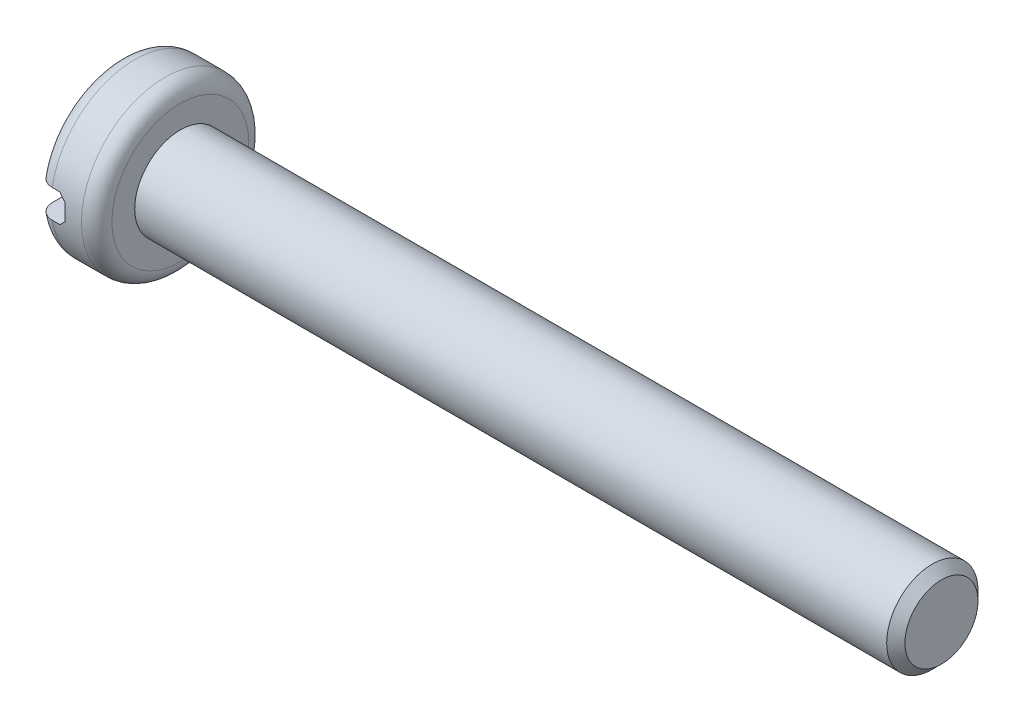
from build123d import *

# Parameters (mm, degrees)
ENL_V_MAT_EXTRU_1_DEPTH = 5
ESQUISSE3_R             = 1.5
EXTRUSION1_DEPTH        = 25
CHANFREIN1_SIZE         = 0.3
CONG_1_R                = 0.5


with BuildPart() as part:
    # Esquisse1 → R_volution1 (revolve)
    with BuildSketch(Plane.XY, mode=Mode.PRIVATE) as r_volution1_sk:
        Polygon((0, 0), (0, 2.75), (0.2, 2.75), (2, 2.75), (2, 0), align=None)
    revolve(r_volution1_sk.sketch.rotate(Axis((0, 0, 0), (1, 0, 0)), 90), axis=Axis((0, 0, 0), (1, 0, 0)))

    # Esquisse2 → Enl_v. mat.-Extru.1 (cut, symmetric)
    with BuildSketch(Plane.XY):
        Polygon((0, 0.465549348), (0.753445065, 0.465549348), (0.953445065, 0.265549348), (0.953445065, -0.265549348), (0.753445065, -0.465549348), (0, -0.465549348), align=None)
    extrude(amount=ENL_V_MAT_EXTRU_1_DEPTH, both=True, mode=Mode.SUBTRACT)

    # Esquisse3 → Extrusion1 (add)
    with BuildSketch(Plane(origin=(2, 0, 0), x_dir=(0, 0, -1), z_dir=(1, 0, 0))):
        with Locations(Location((0, 0, 0), (0, 0, 180))):
            Circle(ESQUISSE3_R)
    extrude(amount=EXTRUSION1_DEPTH)

    # Chanfrein1
    chanfrein1_edges = [part.edges().sort_by_distance(p)[0] for p in [
        (27, 0, -1.5),
    ]]
    chamfer(chanfrein1_edges, length=CHANFREIN1_SIZE)

    # Cong_1
    cong_1_edges = [part.edges().sort_by_distance(p)[0] for p in [
        (0, -2.75, 0),
        (2, 0, -2.75),
        (0, 2.75, 0),
    ]]
    fillet(cong_1_edges, radius=CONG_1_R)


solid = part.part
